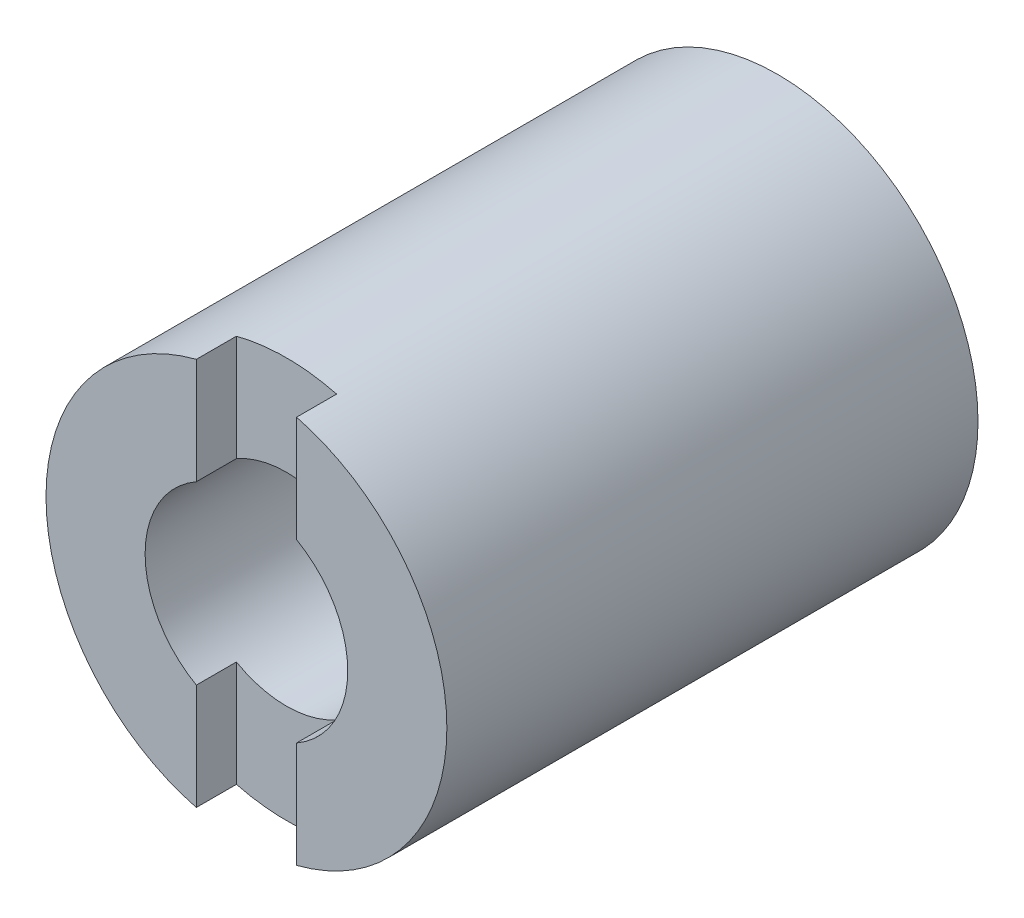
ISO-10303-21;
HEADER;
FILE_DESCRIPTION(('STEP AP214'),'2;1');
FILE_NAME('part.step','',(''),(''),'','','');
FILE_SCHEMA(('AUTOMOTIVE_DESIGN { 1 0 10303 214 1 1 1 1 }'));
ENDSEC;
DATA;
#1=APPLICATION_CONTEXT('core data for automotive mechanical design processes');
#2=APPLICATION_PROTOCOL_DEFINITION('international standard','automotive_design',2000,#1);
#3=PRODUCT_CONTEXT('',#1,'mechanical');
#4=PRODUCT('Part','Part','',(#3));
#5=PRODUCT_RELATED_PRODUCT_CATEGORY('part','',(#4));
#6=PRODUCT_DEFINITION_FORMATION('','',#4);
#7=PRODUCT_DEFINITION_CONTEXT('part definition',#1,'design');
#8=PRODUCT_DEFINITION('design','',#6,#7);
#9=PRODUCT_DEFINITION_SHAPE('','',#8);
#10=(LENGTH_UNIT() NAMED_UNIT(*) SI_UNIT(.MILLI.,.METRE.));
#11=(NAMED_UNIT(*) PLANE_ANGLE_UNIT() SI_UNIT($,.RADIAN.));
#12=(NAMED_UNIT(*) SI_UNIT($,.STERADIAN.) SOLID_ANGLE_UNIT());
#13=UNCERTAINTY_MEASURE_WITH_UNIT(LENGTH_MEASURE(1.E-05),#10,'distance_accuracy_value','');
#14=(GEOMETRIC_REPRESENTATION_CONTEXT(3) GLOBAL_UNCERTAINTY_ASSIGNED_CONTEXT((#13)) GLOBAL_UNIT_ASSIGNED_CONTEXT((#10,
#11,#12)) REPRESENTATION_CONTEXT('',''));
#15=CARTESIAN_POINT('',(0.,0.,0.));
#16=DIRECTION('',(0.,0.,1.));
#17=DIRECTION('',(1.,0.,0.));
#18=AXIS2_PLACEMENT_3D('',#15,#16,#17);
#19=CARTESIAN_POINT('',(0.,0.,26.5));
#20=DIRECTION('',(0.,0.,1.));
#21=DIRECTION('',(1.,0.,0.));
#22=AXIS2_PLACEMENT_3D('',#19,#20,#21);
#23=PLANE('',#22);
#24=DIRECTION('',(0.,-1.,0.));
#25=VECTOR('',#24,1.);
#26=CARTESIAN_POINT('',(-2.5,11.,26.5));
#27=LINE('',#26,#25);
#28=CARTESIAN_POINT('',(-2.5,9.68245836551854,26.5));
#29=VERTEX_POINT('',#28);
#30=CARTESIAN_POINT('',(-2.5,4.39352079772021,26.5));
#31=VERTEX_POINT('',#30);
#32=EDGE_CURVE('E414',#29,#31,#27,.T.);
#33=ORIENTED_EDGE('',*,*,#32,.F.);
#34=CARTESIAN_POINT('',(0.,0.,26.5));
#35=DIRECTION('',(0.,0.,1.));
#36=DIRECTION('',(1.,0.,0.));
#37=AXIS2_PLACEMENT_3D('',#34,#35,#36);
#38=CIRCLE('',#37,10.);
#39=CARTESIAN_POINT('',(-2.5,-9.68245836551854,26.5));
#40=VERTEX_POINT('',#39);
#41=EDGE_CURVE('E426',#29,#40,#38,.T.);
#42=ORIENTED_EDGE('',*,*,#41,.T.);
#43=CARTESIAN_POINT('',(-2.5,-4.39352079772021,26.5));
#44=VERTEX_POINT('',#43);
#45=EDGE_CURVE('E430',#44,#40,#27,.T.);
#46=ORIENTED_EDGE('',*,*,#45,.F.);
#47=CARTESIAN_POINT('',(0.,0.,26.5));
#48=DIRECTION('',(0.,0.,1.));
#49=DIRECTION('',(1.,0.,0.));
#50=AXIS2_PLACEMENT_3D('',#47,#48,#49);
#51=CIRCLE('',#50,5.055);
#52=EDGE_CURVE('E428',#31,#44,#51,.T.);
#53=ORIENTED_EDGE('',*,*,#52,.F.);
#54=EDGE_LOOP('',(#33,#42,#46,#53));
#55=FACE_BOUND('',#54,.T.);
#56=ADVANCED_FACE('F348',(#55),#23,.T.);
#57=DIRECTION('',(0.,1.,0.));
#58=VECTOR('',#57,1.);
#59=CARTESIAN_POINT('',(2.5,11.,26.5));
#60=LINE('',#59,#58);
#61=CARTESIAN_POINT('',(2.5,-9.68245836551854,26.5));
#62=VERTEX_POINT('',#61);
#63=CARTESIAN_POINT('',(2.5,-4.39352079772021,26.5));
#64=VERTEX_POINT('',#63);
#65=EDGE_CURVE('E509',#62,#64,#60,.T.);
#66=ORIENTED_EDGE('',*,*,#65,.F.);
#67=CARTESIAN_POINT('',(2.5,9.68245836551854,26.5));
#68=VERTEX_POINT('',#67);
#69=EDGE_CURVE('E436',#62,#68,#38,.T.);
#70=ORIENTED_EDGE('',*,*,#69,.T.);
#71=CARTESIAN_POINT('',(2.5,4.39352079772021,26.5));
#72=VERTEX_POINT('',#71);
#73=EDGE_CURVE('E429',#72,#68,#60,.T.);
#74=ORIENTED_EDGE('',*,*,#73,.F.);
#75=EDGE_CURVE('E478',#64,#72,#51,.T.);
#76=ORIENTED_EDGE('',*,*,#75,.F.);
#77=EDGE_LOOP('',(#66,#70,#74,#76));
#78=FACE_BOUND('',#77,.T.);
#79=ADVANCED_FACE('F488',(#78),#23,.T.);
#80=CARTESIAN_POINT('',(0.,0.,0.));
#81=DIRECTION('',(0.,0.,1.));
#82=DIRECTION('',(1.,0.,0.));
#83=AXIS2_PLACEMENT_3D('',#80,#81,#82);
#84=PLANE('',#83);
#85=CARTESIAN_POINT('',(0.,0.,0.));
#86=DIRECTION('',(0.,0.,1.));
#87=DIRECTION('',(1.,0.,0.));
#88=AXIS2_PLACEMENT_3D('',#85,#86,#87);
#89=CIRCLE('',#88,10.);
#90=CARTESIAN_POINT('',(10.,0.,0.));
#91=VERTEX_POINT('',#90);
#92=EDGE_CURVE('E443',#91,#91,#89,.T.);
#93=ORIENTED_EDGE('',*,*,#92,.F.);
#94=EDGE_LOOP('',(#93));
#95=FACE_BOUND('',#94,.T.);
#96=CARTESIAN_POINT('',(0.,0.,0.));
#97=DIRECTION('',(0.,0.,1.));
#98=DIRECTION('',(1.,0.,0.));
#99=AXIS2_PLACEMENT_3D('',#96,#97,#98);
#100=CIRCLE('',#99,5.055);
#101=CARTESIAN_POINT('',(5.055,0.,0.));
#102=VERTEX_POINT('',#101);
#103=EDGE_CURVE('E419',#102,#102,#100,.T.);
#104=ORIENTED_EDGE('',*,*,#103,.T.);
#105=EDGE_LOOP('',(#104));
#106=FACE_BOUND('',#105,.T.);
#107=ADVANCED_FACE('F485',(#95,#106),#84,.F.);
#108=CARTESIAN_POINT('',(0.,0.,26.5));
#109=DIRECTION('',(0.,0.,-1.));
#110=DIRECTION('',(-1.,0.,0.));
#111=AXIS2_PLACEMENT_3D('',#108,#109,#110);
#112=CYLINDRICAL_SURFACE('',#111,10.);
#113=ORIENTED_EDGE('',*,*,#41,.F.);
#114=DIRECTION('',(0.,0.,-1.));
#115=VECTOR('',#114,1.);
#116=CARTESIAN_POINT('',(-2.5,9.68245836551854,26.5));
#117=LINE('',#116,#115);
#118=CARTESIAN_POINT('',(-2.5,9.68245836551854,24.5));
#119=VERTEX_POINT('',#118);
#120=EDGE_CURVE('E411',#29,#119,#117,.T.);
#121=ORIENTED_EDGE('',*,*,#120,.T.);
#122=CARTESIAN_POINT('',(0.,0.,24.5));
#123=DIRECTION('',(0.,0.,1.));
#124=DIRECTION('',(1.,0.,0.));
#125=AXIS2_PLACEMENT_3D('',#122,#123,#124);
#126=CIRCLE('',#125,10.);
#127=CARTESIAN_POINT('',(2.5,9.68245836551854,24.5));
#128=VERTEX_POINT('',#127);
#129=EDGE_CURVE('E471',#128,#119,#126,.T.);
#130=ORIENTED_EDGE('',*,*,#129,.F.);
#131=DIRECTION('',(0.,0.,-1.));
#132=VECTOR('',#131,1.);
#133=CARTESIAN_POINT('',(2.5,9.68245836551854,26.5));
#134=LINE('',#133,#132);
#135=EDGE_CURVE('E463',#128,#68,#134,.F.);
#136=ORIENTED_EDGE('',*,*,#135,.T.);
#137=ORIENTED_EDGE('',*,*,#69,.F.);
#138=DIRECTION('',(0.,0.,-1.));
#139=VECTOR('',#138,1.);
#140=CARTESIAN_POINT('',(2.5,-9.68245836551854,26.5));
#141=LINE('',#140,#139);
#142=CARTESIAN_POINT('',(2.5,-9.68245836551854,24.5));
#143=VERTEX_POINT('',#142);
#144=EDGE_CURVE('E473',#62,#143,#141,.T.);
#145=ORIENTED_EDGE('',*,*,#144,.T.);
#146=CARTESIAN_POINT('',(-2.5,-9.68245836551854,24.5));
#147=VERTEX_POINT('',#146);
#148=EDGE_CURVE('E465',#147,#143,#126,.T.);
#149=ORIENTED_EDGE('',*,*,#148,.F.);
#150=DIRECTION('',(0.,0.,-1.));
#151=VECTOR('',#150,1.);
#152=CARTESIAN_POINT('',(-2.5,-9.68245836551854,26.5));
#153=LINE('',#152,#151);
#154=EDGE_CURVE('E420',#147,#40,#153,.F.);
#155=ORIENTED_EDGE('',*,*,#154,.T.);
#156=EDGE_LOOP('',(#113,#121,#130,#136,#137,#145,#149,#155));
#157=FACE_BOUND('',#156,.T.);
#158=ORIENTED_EDGE('',*,*,#92,.T.);
#159=EDGE_LOOP('',(#158));
#160=FACE_BOUND('',#159,.T.);
#161=ADVANCED_FACE('F350',(#157,#160),#112,.T.);
#162=CARTESIAN_POINT('',(0.,0.,26.5));
#163=DIRECTION('',(0.,0.,-1.));
#164=DIRECTION('',(-1.,0.,0.));
#165=AXIS2_PLACEMENT_3D('',#162,#163,#164);
#166=CYLINDRICAL_SURFACE('',#165,5.055);
#167=DIRECTION('',(0.,0.,-1.));
#168=VECTOR('',#167,1.);
#169=CARTESIAN_POINT('',(-2.5,4.39352079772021,26.5));
#170=LINE('',#169,#168);
#171=CARTESIAN_POINT('',(-2.5,4.39352079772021,24.5));
#172=VERTEX_POINT('',#171);
#173=EDGE_CURVE('E11',#31,#172,#170,.T.);
#174=ORIENTED_EDGE('',*,*,#173,.F.);
#175=ORIENTED_EDGE('',*,*,#52,.T.);
#176=DIRECTION('',(0.,0.,-1.));
#177=VECTOR('',#176,1.);
#178=CARTESIAN_POINT('',(-2.5,-4.39352079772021,26.5));
#179=LINE('',#178,#177);
#180=CARTESIAN_POINT('',(-2.5,-4.39352079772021,24.5));
#181=VERTEX_POINT('',#180);
#182=EDGE_CURVE('E448',#181,#44,#179,.F.);
#183=ORIENTED_EDGE('',*,*,#182,.F.);
#184=CARTESIAN_POINT('',(0.,0.,24.5));
#185=DIRECTION('',(0.,0.,1.));
#186=DIRECTION('',(1.,0.,0.));
#187=AXIS2_PLACEMENT_3D('',#184,#185,#186);
#188=CIRCLE('',#187,5.055);
#189=CARTESIAN_POINT('',(2.5,-4.39352079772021,24.5));
#190=VERTEX_POINT('',#189);
#191=EDGE_CURVE('E435',#181,#190,#188,.T.);
#192=ORIENTED_EDGE('',*,*,#191,.T.);
#193=DIRECTION('',(0.,0.,-1.));
#194=VECTOR('',#193,1.);
#195=CARTESIAN_POINT('',(2.5,-4.39352079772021,26.5));
#196=LINE('',#195,#194);
#197=EDGE_CURVE('E439',#64,#190,#196,.T.);
#198=ORIENTED_EDGE('',*,*,#197,.F.);
#199=ORIENTED_EDGE('',*,*,#75,.T.);
#200=DIRECTION('',(0.,0.,-1.));
#201=VECTOR('',#200,1.);
#202=CARTESIAN_POINT('',(2.5,4.39352079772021,26.5));
#203=LINE('',#202,#201);
#204=CARTESIAN_POINT('',(2.5,4.39352079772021,24.5));
#205=VERTEX_POINT('',#204);
#206=EDGE_CURVE('E356',#205,#72,#203,.F.);
#207=ORIENTED_EDGE('',*,*,#206,.F.);
#208=EDGE_CURVE('E441',#205,#172,#188,.T.);
#209=ORIENTED_EDGE('',*,*,#208,.T.);
#210=EDGE_LOOP('',(#174,#175,#183,#192,#198,#199,#207,#209));
#211=FACE_BOUND('',#210,.T.);
#212=ORIENTED_EDGE('',*,*,#103,.F.);
#213=EDGE_LOOP('',(#212));
#214=FACE_BOUND('',#213,.T.);
#215=ADVANCED_FACE('F455',(#211,#214),#166,.F.);
#216=CARTESIAN_POINT('',(-2.5,-11.,24.5));
#217=DIRECTION('',(0.,0.,1.));
#218=DIRECTION('',(1.,0.,0.));
#219=AXIS2_PLACEMENT_3D('',#216,#217,#218);
#220=PLANE('',#219);
#221=ORIENTED_EDGE('',*,*,#148,.T.);
#222=DIRECTION('',(0.,1.,0.));
#223=VECTOR('',#222,1.);
#224=CARTESIAN_POINT('',(2.5,11.,24.5));
#225=LINE('',#224,#223);
#226=EDGE_CURVE('E370',#143,#190,#225,.T.);
#227=ORIENTED_EDGE('',*,*,#226,.T.);
#228=ORIENTED_EDGE('',*,*,#191,.F.);
#229=DIRECTION('',(0.,-1.,0.));
#230=VECTOR('',#229,1.);
#231=CARTESIAN_POINT('',(-2.5,11.,24.5));
#232=LINE('',#231,#230);
#233=EDGE_CURVE('E466',#181,#147,#232,.T.);
#234=ORIENTED_EDGE('',*,*,#233,.T.);
#235=EDGE_LOOP('',(#221,#227,#228,#234));
#236=FACE_BOUND('',#235,.T.);
#237=ADVANCED_FACE('F492',(#236),#220,.T.);
#238=CARTESIAN_POINT('',(2.5,11.,24.5));
#239=DIRECTION('',(1.,0.,0.));
#240=DIRECTION('',(0.,1.,0.));
#241=AXIS2_PLACEMENT_3D('',#238,#239,#240);
#242=PLANE('',#241);
#243=ORIENTED_EDGE('',*,*,#65,.T.);
#244=ORIENTED_EDGE('',*,*,#197,.T.);
#245=ORIENTED_EDGE('',*,*,#226,.F.);
#246=ORIENTED_EDGE('',*,*,#144,.F.);
#247=EDGE_LOOP('',(#243,#244,#245,#246));
#248=FACE_BOUND('',#247,.T.);
#249=ADVANCED_FACE('F498',(#248),#242,.F.);
#250=CARTESIAN_POINT('',(-2.5,11.,24.5));
#251=DIRECTION('',(-1.,0.,0.));
#252=DIRECTION('',(0.,-1.,0.));
#253=AXIS2_PLACEMENT_3D('',#250,#251,#252);
#254=PLANE('',#253);
#255=ORIENTED_EDGE('',*,*,#233,.F.);
#256=ORIENTED_EDGE('',*,*,#182,.T.);
#257=ORIENTED_EDGE('',*,*,#45,.T.);
#258=ORIENTED_EDGE('',*,*,#154,.F.);
#259=EDGE_LOOP('',(#255,#256,#257,#258));
#260=FACE_BOUND('',#259,.T.);
#261=ADVANCED_FACE('F515',(#260),#254,.F.);
#262=ORIENTED_EDGE('',*,*,#32,.T.);
#263=ORIENTED_EDGE('',*,*,#173,.T.);
#264=EDGE_CURVE('E363',#119,#172,#232,.T.);
#265=ORIENTED_EDGE('',*,*,#264,.F.);
#266=ORIENTED_EDGE('',*,*,#120,.F.);
#267=EDGE_LOOP('',(#262,#263,#265,#266));
#268=FACE_BOUND('',#267,.T.);
#269=ADVANCED_FACE('F413',(#268),#254,.F.);
#270=EDGE_CURVE('E460',#205,#128,#225,.T.);
#271=ORIENTED_EDGE('',*,*,#270,.F.);
#272=ORIENTED_EDGE('',*,*,#206,.T.);
#273=ORIENTED_EDGE('',*,*,#73,.T.);
#274=ORIENTED_EDGE('',*,*,#135,.F.);
#275=EDGE_LOOP('',(#271,#272,#273,#274));
#276=FACE_BOUND('',#275,.T.);
#277=ADVANCED_FACE('F461',(#276),#242,.F.);
#278=ORIENTED_EDGE('',*,*,#129,.T.);
#279=ORIENTED_EDGE('',*,*,#264,.T.);
#280=ORIENTED_EDGE('',*,*,#208,.F.);
#281=ORIENTED_EDGE('',*,*,#270,.T.);
#282=EDGE_LOOP('',(#278,#279,#280,#281));
#283=FACE_BOUND('',#282,.T.);
#284=ADVANCED_FACE('F459',(#283),#220,.T.);
#285=CLOSED_SHELL('',(#56,#79,#107,#161,#215,#237,#249,#261,#269,#277,#284));
#286=MANIFOLD_SOLID_BREP('B2',#285);
#287=ADVANCED_BREP_SHAPE_REPRESENTATION('',(#18,#286),#14);
#288=SHAPE_DEFINITION_REPRESENTATION(#9,#287);
ENDSEC;
END-ISO-10303-21;
